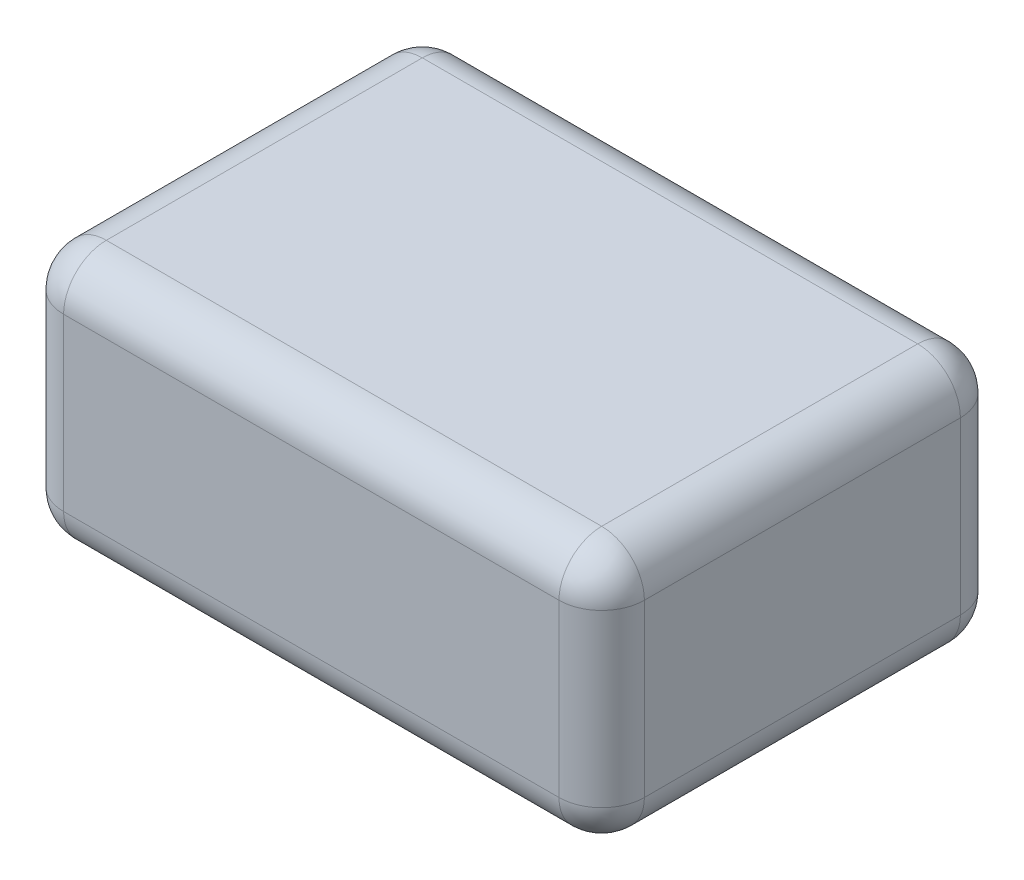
from build123d import *

# Parameters (mm, degrees)
ESQ_PLAQUE_W = 68
ESQ_PLAQUE_H = 30
PLAQUE_DEPTH = 47
CONG_PI_CE_R = 5


with BuildPart() as part:
    # Esq_plaque → plaque (new body)
    with BuildSketch(Plane.XY):
        with Locations((34, 15)):
            Rectangle(ESQ_PLAQUE_W, ESQ_PLAQUE_H)
    extrude(amount=PLAQUE_DEPTH)

    # Cong__pi_ce
    cong_pi_ce_edges = [part.edges().sort_by_distance(p)[0] for p in [
        (68, 15, 47),
        (34, 30, 47),
        (0, 15, 47),
        (34, 30, 0),
        (68, 15, 0),
        (34, 0, 0),
        (0, 15, 0),
        (34, 0, 47),
        (0, 30, 23.5),
        (68, 30, 23.5),
        (68, 0, 23.5),
        (0, 0, 23.5),
    ]]
    fillet(cong_pi_ce_edges, radius=CONG_PI_CE_R)


solid = part.part
